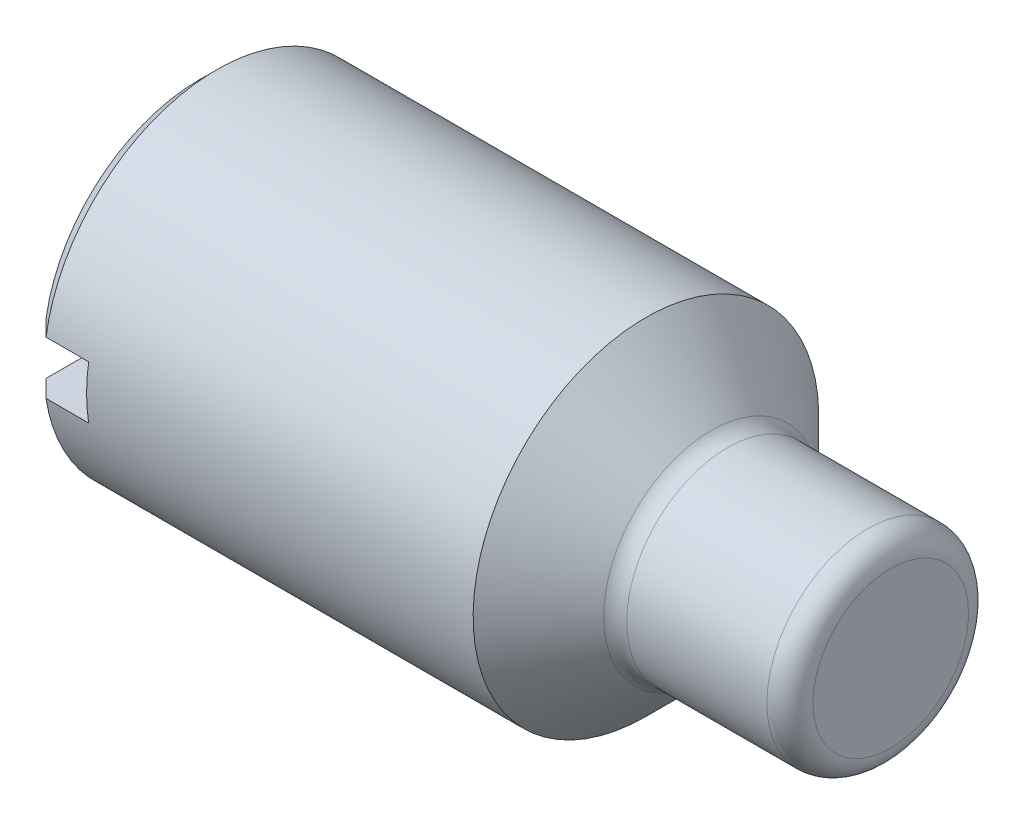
from build123d import *

# Parameters (mm, degrees)
NOTCH_DEPTH      = 7.363961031
NOTCH_DEPTH_BACK = 7.363961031
SKETCH2_W        = 0.52
SKETCH2_H        = 0.46
FILLET1_R        = 0.2
CHAMFER1_SIZE    = 0.15


with BuildPart() as part:
    # Sketch1 → Base (revolve)
    with BuildSketch(Plane.XY, mode=Mode.PRIVATE) as base_sk:
        Polygon((6, 0), (0, 0), (0, 1.5), (3.875, 1.5), (4.5, 0.875), (6, 0.875), align=None)
    revolve(base_sk.sketch.rotate(Axis((-8.57033571, 0, 0), (1, 0, 0)), 180), axis=Axis((-8.57033571, 0, 0), (1, 0, 0)))

    # Sketch2 → Notch (cut, two sides: drawn at the far end of the back side and taken through both)
    with BuildSketch(Plane.XY.offset(-NOTCH_DEPTH_BACK)):
        with Locations((0.26, 0)):
            Rectangle(SKETCH2_W, SKETCH2_H)
    extrude(amount=NOTCH_DEPTH + NOTCH_DEPTH_BACK, mode=Mode.SUBTRACT)

    # Fillet1
    fillet1_edges = [part.edges().sort_by_distance(p)[0] for p in [
        (4.5, 0.875, 0),
        (6, 0.875, 0),
    ]]
    fillet(fillet1_edges, radius=FILLET1_R)

    # Chamfer1
    chamfer1_edges = [part.edges().sort_by_distance(p)[0] for p in [
        (0, 1.5, 0),
        (0, -1.139078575, 0.975961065),
    ]]
    chamfer(chamfer1_edges, length=CHAMFER1_SIZE)


solid = part.part
